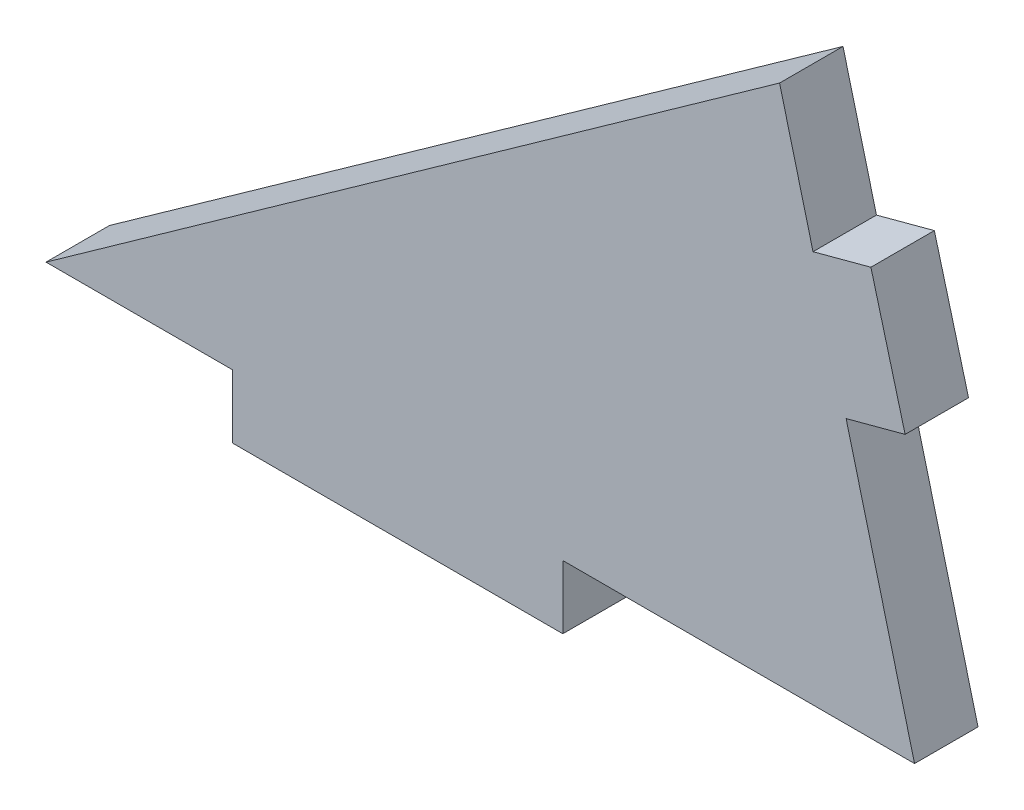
from build123d import *

# Parameters (mm, degrees)
BOSS_EXTRUDE1_DEPTH = 1.524


with BuildPart() as part:
    # Sketch1 → Boss-Extrude1 (new body)
    with BuildSketch(Plane.XY):
        Polygon((13.017712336, -1.524), (20.955212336, -1.524), (20.955212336, 0), (29.404282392, 0), (27.760376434, 6.355281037), (29.177412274, 6.734974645), (28.355661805, 9.801789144), (26.965245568, 9.429228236), (26.161675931, 12.53579942), (8.540424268, 0), (13.017712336, 0), align=None)
    extrude(amount=BOSS_EXTRUDE1_DEPTH)


solid = part.part
